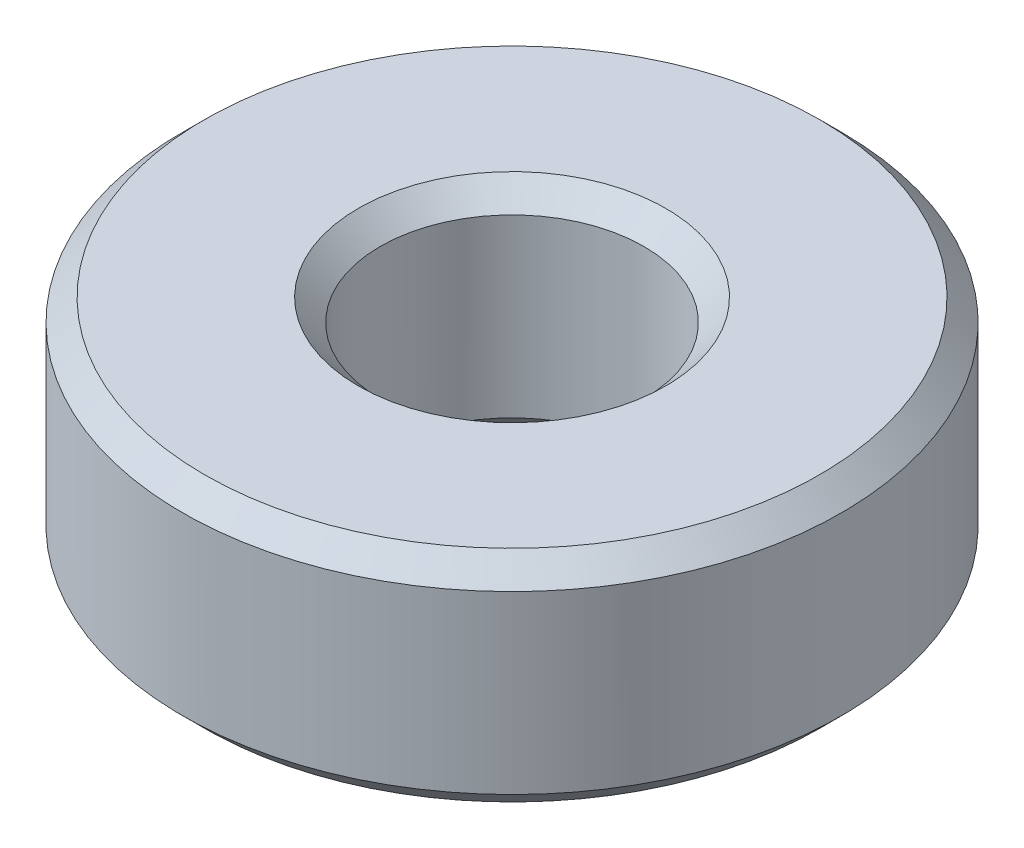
ISO-10303-21;
HEADER;
FILE_DESCRIPTION(('STEP AP214'),'2;1');
FILE_NAME('part.step','',(''),(''),'','','');
FILE_SCHEMA(('AUTOMOTIVE_DESIGN { 1 0 10303 214 1 1 1 1 }'));
ENDSEC;
DATA;
#1=APPLICATION_CONTEXT('core data for automotive mechanical design processes');
#2=APPLICATION_PROTOCOL_DEFINITION('international standard','automotive_design',2000,#1);
#3=PRODUCT_CONTEXT('',#1,'mechanical');
#4=PRODUCT('Part','Part','',(#3));
#5=PRODUCT_RELATED_PRODUCT_CATEGORY('part','',(#4));
#6=PRODUCT_DEFINITION_FORMATION('','',#4);
#7=PRODUCT_DEFINITION_CONTEXT('part definition',#1,'design');
#8=PRODUCT_DEFINITION('design','',#6,#7);
#9=PRODUCT_DEFINITION_SHAPE('','',#8);
#10=(LENGTH_UNIT() NAMED_UNIT(*) SI_UNIT(.MILLI.,.METRE.));
#11=(NAMED_UNIT(*) PLANE_ANGLE_UNIT() SI_UNIT($,.RADIAN.));
#12=(NAMED_UNIT(*) SI_UNIT($,.STERADIAN.) SOLID_ANGLE_UNIT());
#13=UNCERTAINTY_MEASURE_WITH_UNIT(LENGTH_MEASURE(1.E-05),#10,'distance_accuracy_value','');
#14=(GEOMETRIC_REPRESENTATION_CONTEXT(3) GLOBAL_UNCERTAINTY_ASSIGNED_CONTEXT((#13)) GLOBAL_UNIT_ASSIGNED_CONTEXT((#10,
#11,#12)) REPRESENTATION_CONTEXT('',''));
#15=CARTESIAN_POINT('',(0.,0.,0.));
#16=DIRECTION('',(0.,0.,1.));
#17=DIRECTION('',(1.,0.,0.));
#18=AXIS2_PLACEMENT_3D('',#15,#16,#17);
#19=CARTESIAN_POINT('',(0.,0.,0.));
#20=DIRECTION('',(0.,1.,0.));
#21=DIRECTION('',(0.,0.,1.));
#22=AXIS2_PLACEMENT_3D('',#19,#20,#21);
#23=PLANE('',#22);
#24=CARTESIAN_POINT('',(0.,0.,0.));
#25=DIRECTION('',(0.,1.,0.));
#26=DIRECTION('',(-1.,0.,0.));
#27=AXIS2_PLACEMENT_3D('',#24,#25,#26);
#28=CIRCLE('',#27,7.);
#29=CARTESIAN_POINT('',(-7.,0.,0.));
#30=VERTEX_POINT('',#29);
#31=EDGE_CURVE('E32',#30,#30,#28,.T.);
#32=ORIENTED_EDGE('',*,*,#31,.F.);
#33=EDGE_LOOP('',(#32));
#34=FACE_BOUND('',#33,.T.);
#35=CARTESIAN_POINT('',(0.,-5.6843418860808E-11,0.));
#36=DIRECTION('',(0.,-1.,0.));
#37=DIRECTION('',(0.,0.,-1.));
#38=AXIS2_PLACEMENT_3D('',#35,#36,#37);
#39=CIRCLE('',#38,3.50000000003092);
#40=CARTESIAN_POINT('',(0.,-5.6843418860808E-11,-3.50000000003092));
#41=VERTEX_POINT('',#40);
#42=EDGE_CURVE('E18',#41,#41,#39,.F.);
#43=ORIENTED_EDGE('',*,*,#42,.T.);
#44=EDGE_LOOP('',(#43));
#45=FACE_BOUND('',#44,.T.);
#46=ADVANCED_FACE('F15',(#34,#45),#23,.F.);
#47=CARTESIAN_POINT('',(0.,-1.13686837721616E-10,0.));
#48=DIRECTION('',(0.,-1.,0.));
#49=DIRECTION('',(0.,0.,-1.));
#50=AXIS2_PLACEMENT_3D('',#47,#48,#49);
#51=CONICAL_SURFACE('',#50,3.50000000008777,0.785398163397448);
#52=CARTESIAN_POINT('',(0.,0.499999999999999,0.));
#53=DIRECTION('',(0.,-1.,0.));
#54=DIRECTION('',(0.,0.,-1.));
#55=AXIS2_PLACEMENT_3D('',#52,#53,#54);
#56=CIRCLE('',#55,3.);
#57=CARTESIAN_POINT('',(0.,0.499999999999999,-3.));
#58=VERTEX_POINT('',#57);
#59=EDGE_CURVE('E30',#58,#58,#56,.F.);
#60=ORIENTED_EDGE('',*,*,#59,.T.);
#61=EDGE_LOOP('',(#60));
#62=FACE_BOUND('',#61,.T.);
#63=ORIENTED_EDGE('',*,*,#42,.F.);
#64=EDGE_LOOP('',(#63));
#65=FACE_BOUND('',#64,.T.);
#66=ADVANCED_FACE('F42',(#62,#65),#51,.F.);
#67=CARTESIAN_POINT('',(0.,0.499999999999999,0.));
#68=DIRECTION('',(0.,1.,0.));
#69=DIRECTION('',(-1.,0.,0.));
#70=AXIS2_PLACEMENT_3D('',#67,#68,#69);
#71=CONICAL_SURFACE('',#70,7.5,0.78539816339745);
#72=CARTESIAN_POINT('',(0.,0.5,0.));
#73=DIRECTION('',(0.,-1.,0.));
#74=DIRECTION('',(0.,0.,-1.));
#75=AXIS2_PLACEMENT_3D('',#72,#73,#74);
#76=CIRCLE('',#75,7.5);
#77=CARTESIAN_POINT('',(0.,0.5,-7.5));
#78=VERTEX_POINT('',#77);
#79=EDGE_CURVE('E37',#78,#78,#76,.F.);
#80=ORIENTED_EDGE('',*,*,#79,.F.);
#81=EDGE_LOOP('',(#80));
#82=FACE_BOUND('',#81,.T.);
#83=ORIENTED_EDGE('',*,*,#31,.T.);
#84=EDGE_LOOP('',(#83));
#85=FACE_BOUND('',#84,.T.);
#86=ADVANCED_FACE('F44',(#82,#85),#71,.T.);
#87=CARTESIAN_POINT('',(0.,5.,0.));
#88=DIRECTION('',(0.,-1.,0.));
#89=DIRECTION('',(0.,0.,-1.));
#90=AXIS2_PLACEMENT_3D('',#87,#88,#89);
#91=CYLINDRICAL_SURFACE('',#90,3.);
#92=CARTESIAN_POINT('',(0.,4.50000000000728,0.));
#93=DIRECTION('',(0.,1.,0.));
#94=DIRECTION('',(0.,0.,1.));
#95=AXIS2_PLACEMENT_3D('',#92,#93,#94);
#96=CIRCLE('',#95,2.9999999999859);
#97=CARTESIAN_POINT('',(0.,4.50000000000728,2.9999999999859));
#98=VERTEX_POINT('',#97);
#99=EDGE_CURVE('E81',#98,#98,#96,.T.);
#100=ORIENTED_EDGE('',*,*,#99,.T.);
#101=EDGE_LOOP('',(#100));
#102=FACE_BOUND('',#101,.T.);
#103=ORIENTED_EDGE('',*,*,#59,.F.);
#104=EDGE_LOOP('',(#103));
#105=FACE_BOUND('',#104,.T.);
#106=ADVANCED_FACE('F51',(#102,#105),#91,.F.);
#107=CARTESIAN_POINT('',(0.,5.,0.));
#108=DIRECTION('',(0.,-1.,0.));
#109=DIRECTION('',(0.,0.,-1.));
#110=AXIS2_PLACEMENT_3D('',#107,#108,#109);
#111=CYLINDRICAL_SURFACE('',#110,7.5);
#112=ORIENTED_EDGE('',*,*,#79,.T.);
#113=EDGE_LOOP('',(#112));
#114=FACE_BOUND('',#113,.T.);
#115=CARTESIAN_POINT('',(0.,4.5,0.));
#116=DIRECTION('',(0.,-1.,0.));
#117=DIRECTION('',(0.,0.,-1.));
#118=AXIS2_PLACEMENT_3D('',#115,#116,#117);
#119=CIRCLE('',#118,7.5);
#120=CARTESIAN_POINT('',(0.,4.5,-7.5));
#121=VERTEX_POINT('',#120);
#122=EDGE_CURVE('E27',#121,#121,#119,.F.);
#123=ORIENTED_EDGE('',*,*,#122,.F.);
#124=EDGE_LOOP('',(#123));
#125=FACE_BOUND('',#124,.T.);
#126=ADVANCED_FACE('F69',(#114,#125),#111,.T.);
#127=CARTESIAN_POINT('',(0.,4.99999999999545,0.));
#128=DIRECTION('',(0.,1.,0.));
#129=DIRECTION('',(0.,0.,1.));
#130=AXIS2_PLACEMENT_3D('',#127,#128,#129);
#131=CONICAL_SURFACE('',#130,3.49999999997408,0.785398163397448);
#132=ORIENTED_EDGE('',*,*,#99,.F.);
#133=EDGE_LOOP('',(#132));
#134=FACE_BOUND('',#133,.T.);
#135=CARTESIAN_POINT('',(0.,4.99999999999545,0.));
#136=DIRECTION('',(0.,1.,0.));
#137=DIRECTION('',(0.,0.,1.));
#138=AXIS2_PLACEMENT_3D('',#135,#136,#137);
#139=CIRCLE('',#138,3.49999999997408);
#140=CARTESIAN_POINT('',(0.,4.99999999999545,3.49999999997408));
#141=VERTEX_POINT('',#140);
#142=EDGE_CURVE('E22',#141,#141,#139,.F.);
#143=ORIENTED_EDGE('',*,*,#142,.F.);
#144=EDGE_LOOP('',(#143));
#145=FACE_BOUND('',#144,.T.);
#146=ADVANCED_FACE('F62',(#134,#145),#131,.F.);
#147=CARTESIAN_POINT('',(0.,4.5,0.));
#148=DIRECTION('',(0.,-1.,0.));
#149=DIRECTION('',(0.,0.,-1.));
#150=AXIS2_PLACEMENT_3D('',#147,#148,#149);
#151=CONICAL_SURFACE('',#150,7.5,0.785398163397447);
#152=ORIENTED_EDGE('',*,*,#122,.T.);
#153=EDGE_LOOP('',(#152));
#154=FACE_BOUND('',#153,.T.);
#155=CARTESIAN_POINT('',(0.,5.,0.));
#156=DIRECTION('',(0.,-1.,0.));
#157=DIRECTION('',(0.,0.,-1.));
#158=AXIS2_PLACEMENT_3D('',#155,#156,#157);
#159=CIRCLE('',#158,7.);
#160=CARTESIAN_POINT('',(0.,5.,-7.));
#161=VERTEX_POINT('',#160);
#162=EDGE_CURVE('E10',#161,#161,#159,.F.);
#163=ORIENTED_EDGE('',*,*,#162,.F.);
#164=EDGE_LOOP('',(#163));
#165=FACE_BOUND('',#164,.T.);
#166=ADVANCED_FACE('F57',(#154,#165),#151,.T.);
#167=CARTESIAN_POINT('',(0.,5.,0.));
#168=DIRECTION('',(0.,1.,0.));
#169=DIRECTION('',(0.,0.,1.));
#170=AXIS2_PLACEMENT_3D('',#167,#168,#169);
#171=PLANE('',#170);
#172=ORIENTED_EDGE('',*,*,#162,.T.);
#173=EDGE_LOOP('',(#172));
#174=FACE_BOUND('',#173,.T.);
#175=ORIENTED_EDGE('',*,*,#142,.T.);
#176=EDGE_LOOP('',(#175));
#177=FACE_BOUND('',#176,.T.);
#178=ADVANCED_FACE('F55',(#174,#177),#171,.T.);
#179=CLOSED_SHELL('',(#46,#66,#86,#106,#126,#146,#166,#178));
#180=MANIFOLD_SOLID_BREP('B1',#179);
#181=ADVANCED_BREP_SHAPE_REPRESENTATION('',(#18,#180),#14);
#182=SHAPE_DEFINITION_REPRESENTATION(#9,#181);
ENDSEC;
END-ISO-10303-21;
